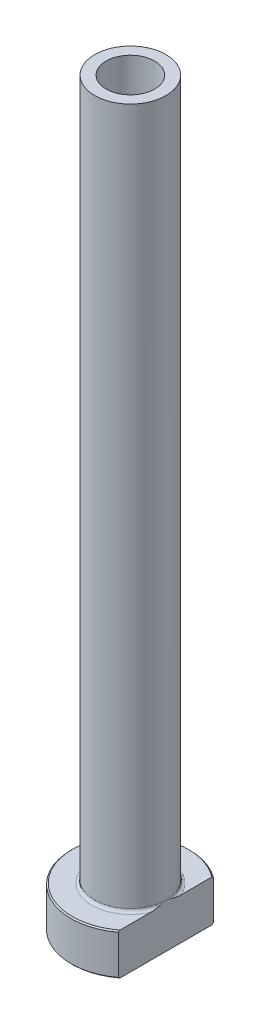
ISO-10303-21;
HEADER;
FILE_DESCRIPTION(('STEP AP214'),'2;1');
FILE_NAME('part.step','',(''),(''),'','','');
FILE_SCHEMA(('AUTOMOTIVE_DESIGN { 1 0 10303 214 1 1 1 1 }'));
ENDSEC;
DATA;
#1=APPLICATION_CONTEXT('core data for automotive mechanical design processes');
#2=APPLICATION_PROTOCOL_DEFINITION('international standard','automotive_design',2000,#1);
#3=PRODUCT_CONTEXT('',#1,'mechanical');
#4=PRODUCT('Part','Part','',(#3));
#5=PRODUCT_RELATED_PRODUCT_CATEGORY('part','',(#4));
#6=PRODUCT_DEFINITION_FORMATION('','',#4);
#7=PRODUCT_DEFINITION_CONTEXT('part definition',#1,'design');
#8=PRODUCT_DEFINITION('design','',#6,#7);
#9=PRODUCT_DEFINITION_SHAPE('','',#8);
#10=(LENGTH_UNIT() NAMED_UNIT(*) SI_UNIT(.MILLI.,.METRE.));
#11=(NAMED_UNIT(*) PLANE_ANGLE_UNIT() SI_UNIT($,.RADIAN.));
#12=(NAMED_UNIT(*) SI_UNIT($,.STERADIAN.) SOLID_ANGLE_UNIT());
#13=UNCERTAINTY_MEASURE_WITH_UNIT(LENGTH_MEASURE(1.E-05),#10,'distance_accuracy_value','');
#14=(GEOMETRIC_REPRESENTATION_CONTEXT(3) GLOBAL_UNCERTAINTY_ASSIGNED_CONTEXT((#13)) GLOBAL_UNIT_ASSIGNED_CONTEXT((#10,
#11,#12)) REPRESENTATION_CONTEXT('',''));
#15=CARTESIAN_POINT('',(0.,0.,0.));
#16=DIRECTION('',(0.,0.,1.));
#17=DIRECTION('',(1.,0.,0.));
#18=AXIS2_PLACEMENT_3D('',#15,#16,#17);
#19=CARTESIAN_POINT('',(0.,92.1876809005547,0.));
#20=DIRECTION('',(0.,1.,0.));
#21=DIRECTION('',(0.,0.,1.));
#22=AXIS2_PLACEMENT_3D('',#19,#20,#21);
#23=CYLINDRICAL_SURFACE('',#22,4.1);
#24=CARTESIAN_POINT('',(0.,125.,0.));
#25=DIRECTION('',(0.,1.,0.));
#26=DIRECTION('',(0.,0.,1.));
#27=AXIS2_PLACEMENT_3D('',#24,#25,#26);
#28=CIRCLE('',#27,4.1);
#29=CARTESIAN_POINT('',(0.,125.,4.1));
#30=VERTEX_POINT('',#29);
#31=EDGE_CURVE('E167',#30,#30,#28,.T.);
#32=ORIENTED_EDGE('',*,*,#31,.T.);
#33=EDGE_LOOP('',(#32));
#34=FACE_BOUND('',#33,.T.);
#35=CARTESIAN_POINT('',(0.,80.,0.));
#36=DIRECTION('',(0.,1.,0.));
#37=DIRECTION('',(0.,0.,1.));
#38=AXIS2_PLACEMENT_3D('',#35,#36,#37);
#39=CIRCLE('',#38,4.1);
#40=CARTESIAN_POINT('',(0.,80.,4.1));
#41=VERTEX_POINT('',#40);
#42=EDGE_CURVE('E170',#41,#41,#39,.T.);
#43=ORIENTED_EDGE('',*,*,#42,.F.);
#44=EDGE_LOOP('',(#43));
#45=FACE_BOUND('',#44,.T.);
#46=ADVANCED_FACE('F32',(#34,#45),#23,.F.);
#47=CARTESIAN_POINT('',(-4.1,125.,0.));
#48=DIRECTION('',(0.,1.,0.));
#49=DIRECTION('',(0.,0.,1.));
#50=AXIS2_PLACEMENT_3D('',#47,#48,#49);
#51=PLANE('',#50);
#52=CARTESIAN_POINT('',(0.,125.,0.));
#53=DIRECTION('',(0.,1.,0.));
#54=DIRECTION('',(0.,0.,1.));
#55=AXIS2_PLACEMENT_3D('',#52,#53,#54);
#56=CIRCLE('',#55,6.);
#57=CARTESIAN_POINT('',(0.,125.,6.));
#58=VERTEX_POINT('',#57);
#59=EDGE_CURVE('E174',#58,#58,#56,.T.);
#60=ORIENTED_EDGE('',*,*,#59,.T.);
#61=EDGE_LOOP('',(#60));
#62=FACE_BOUND('',#61,.T.);
#63=ORIENTED_EDGE('',*,*,#31,.F.);
#64=EDGE_LOOP('',(#63));
#65=FACE_BOUND('',#64,.T.);
#66=ADVANCED_FACE('F157',(#62,#65),#51,.T.);
#67=CARTESIAN_POINT('',(0.,92.1876809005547,0.));
#68=DIRECTION('',(0.,1.,0.));
#69=DIRECTION('',(0.,0.,1.));
#70=AXIS2_PLACEMENT_3D('',#67,#68,#69);
#71=CYLINDRICAL_SURFACE('',#70,6.);
#72=CARTESIAN_POINT('',(0.,7.50000000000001,0.));
#73=DIRECTION('',(0.,1.,0.));
#74=DIRECTION('',(0.,0.,1.));
#75=AXIS2_PLACEMENT_3D('',#72,#73,#74);
#76=CIRCLE('',#75,6.);
#77=CARTESIAN_POINT('',(6.,7.50000000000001,0.));
#78=VERTEX_POINT('',#77);
#79=EDGE_CURVE('E180',#78,#78,#76,.T.);
#80=ORIENTED_EDGE('',*,*,#79,.T.);
#81=EDGE_LOOP('',(#80));
#82=FACE_BOUND('',#81,.T.);
#83=ORIENTED_EDGE('',*,*,#59,.F.);
#84=EDGE_LOOP('',(#83));
#85=FACE_BOUND('',#84,.T.);
#86=ADVANCED_FACE('F162',(#82,#85),#71,.T.);
#87=CARTESIAN_POINT('',(-5.99999999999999,7.,0.));
#88=DIRECTION('',(0.,1.,0.));
#89=DIRECTION('',(0.,0.,1.));
#90=AXIS2_PLACEMENT_3D('',#87,#88,#89);
#91=PLANE('',#90);
#92=DIRECTION('',(0.,0.,1.));
#93=VECTOR('',#92,1.);
#94=CARTESIAN_POINT('',(6.,7.,0.));
#95=LINE('',#94,#93);
#96=CARTESIAN_POINT('',(6.,7.,-7.7485482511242));
#97=VERTEX_POINT('',#96);
#98=CARTESIAN_POINT('',(6.,7.,-2.5));
#99=VERTEX_POINT('',#98);
#100=EDGE_CURVE('E54',#97,#99,#95,.T.);
#101=ORIENTED_EDGE('',*,*,#100,.F.);
#102=CARTESIAN_POINT('',(0.,7.,0.));
#103=DIRECTION('',(0.,1.,0.));
#104=DIRECTION('',(0.,0.,1.));
#105=AXIS2_PLACEMENT_3D('',#102,#103,#104);
#106=CIRCLE('',#105,9.79999999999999);
#107=CARTESIAN_POINT('',(5.99999999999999,7.,7.7485482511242));
#108=VERTEX_POINT('',#107);
#109=EDGE_CURVE('E186',#97,#108,#106,.T.);
#110=ORIENTED_EDGE('',*,*,#109,.T.);
#111=CARTESIAN_POINT('',(6.,7.,2.5));
#112=VERTEX_POINT('',#111);
#113=EDGE_CURVE('E134',#112,#108,#95,.T.);
#114=ORIENTED_EDGE('',*,*,#113,.F.);
#115=CARTESIAN_POINT('',(0.,7.,0.));
#116=DIRECTION('',(0.,1.,0.));
#117=DIRECTION('',(0.,0.,1.));
#118=AXIS2_PLACEMENT_3D('',#115,#116,#117);
#119=CIRCLE('',#118,6.5);
#120=EDGE_CURVE('E183',#112,#99,#119,.F.);
#121=ORIENTED_EDGE('',*,*,#120,.T.);
#122=EDGE_LOOP('',(#101,#110,#114,#121));
#123=FACE_BOUND('',#122,.T.);
#124=ADVANCED_FACE('F197',(#123),#91,.T.);
#125=CARTESIAN_POINT('',(0.,92.1876809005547,0.));
#126=DIRECTION('',(0.,1.,0.));
#127=DIRECTION('',(0.,0.,1.));
#128=AXIS2_PLACEMENT_3D('',#125,#126,#127);
#129=CYLINDRICAL_SURFACE('',#128,9.99999999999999);
#130=DIRECTION('',(0.,-1.,0.));
#131=VECTOR('',#130,1.);
#132=CARTESIAN_POINT('',(5.99999999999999,125.,7.99999999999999));
#133=LINE('',#132,#131);
#134=CARTESIAN_POINT('',(5.99999999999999,6.8,7.99999999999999));
#135=VERTEX_POINT('',#134);
#136=CARTESIAN_POINT('',(5.99999999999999,0.200000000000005,7.99999999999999));
#137=VERTEX_POINT('',#136);
#138=EDGE_CURVE('E82',#135,#137,#133,.T.);
#139=ORIENTED_EDGE('',*,*,#138,.F.);
#140=CARTESIAN_POINT('',(0.,6.8,0.));
#141=DIRECTION('',(0.,1.,0.));
#142=DIRECTION('',(0.,0.,1.));
#143=AXIS2_PLACEMENT_3D('',#140,#141,#142);
#144=CIRCLE('',#143,9.99999999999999);
#145=CARTESIAN_POINT('',(6.,6.8,-7.99999999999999));
#146=VERTEX_POINT('',#145);
#147=EDGE_CURVE('E95',#135,#146,#144,.F.);
#148=ORIENTED_EDGE('',*,*,#147,.T.);
#149=DIRECTION('',(0.,-1.,0.));
#150=VECTOR('',#149,1.);
#151=CARTESIAN_POINT('',(6.,125.,-7.99999999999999));
#152=LINE('',#151,#150);
#153=CARTESIAN_POINT('',(6.,0.200000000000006,-7.99999999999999));
#154=VERTEX_POINT('',#153);
#155=EDGE_CURVE('E192',#146,#154,#152,.T.);
#156=ORIENTED_EDGE('',*,*,#155,.T.);
#157=CARTESIAN_POINT('',(0.,0.200000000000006,0.));
#158=DIRECTION('',(0.,-1.,0.));
#159=DIRECTION('',(0.,0.,-1.));
#160=AXIS2_PLACEMENT_3D('',#157,#158,#159);
#161=CIRCLE('',#160,9.99999999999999);
#162=EDGE_CURVE('E98',#154,#137,#161,.F.);
#163=ORIENTED_EDGE('',*,*,#162,.T.);
#164=EDGE_LOOP('',(#139,#148,#156,#163));
#165=FACE_BOUND('',#164,.T.);
#166=ADVANCED_FACE('F190',(#165),#129,.T.);
#167=CARTESIAN_POINT('',(-9.99999999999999,0.,0.));
#168=DIRECTION('',(0.,-1.,0.));
#169=DIRECTION('',(0.,0.,-1.));
#170=AXIS2_PLACEMENT_3D('',#167,#168,#169);
#171=PLANE('',#170);
#172=CARTESIAN_POINT('',(0.,0.,0.));
#173=DIRECTION('',(0.,-1.,0.));
#174=DIRECTION('',(0.,0.,-1.));
#175=AXIS2_PLACEMENT_3D('',#172,#173,#174);
#176=CIRCLE('',#175,4.84999999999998);
#177=CARTESIAN_POINT('',(0.,0.,-4.84999999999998));
#178=VERTEX_POINT('',#177);
#179=EDGE_CURVE('E40',#178,#178,#176,.F.);
#180=ORIENTED_EDGE('',*,*,#179,.T.);
#181=EDGE_LOOP('',(#180));
#182=FACE_BOUND('',#181,.T.);
#183=DIRECTION('',(0.,0.,-1.));
#184=VECTOR('',#183,1.);
#185=CARTESIAN_POINT('',(5.99999999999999,0.,7.99999999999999));
#186=LINE('',#185,#184);
#187=CARTESIAN_POINT('',(5.99999999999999,0.,7.74854825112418));
#188=VERTEX_POINT('',#187);
#189=CARTESIAN_POINT('',(6.,0.,-7.74854825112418));
#190=VERTEX_POINT('',#189);
#191=EDGE_CURVE('E47',#188,#190,#186,.T.);
#192=ORIENTED_EDGE('',*,*,#191,.F.);
#193=CARTESIAN_POINT('',(0.,0.,0.));
#194=DIRECTION('',(0.,-1.,0.));
#195=DIRECTION('',(0.,0.,-1.));
#196=AXIS2_PLACEMENT_3D('',#193,#194,#195);
#197=CIRCLE('',#196,9.79999999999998);
#198=EDGE_CURVE('E92',#188,#190,#197,.T.);
#199=ORIENTED_EDGE('',*,*,#198,.T.);
#200=EDGE_LOOP('',(#192,#199));
#201=FACE_BOUND('',#200,.T.);
#202=ADVANCED_FACE('F91',(#182,#201),#171,.T.);
#203=CARTESIAN_POINT('',(0.,92.1876809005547,0.));
#204=DIRECTION('',(0.,1.,0.));
#205=DIRECTION('',(0.,0.,1.));
#206=AXIS2_PLACEMENT_3D('',#203,#204,#205);
#207=CYLINDRICAL_SURFACE('',#206,4.34999999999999);
#208=CARTESIAN_POINT('',(0.,0.5,0.));
#209=DIRECTION('',(0.,-1.,0.));
#210=DIRECTION('',(0.,0.,-1.));
#211=AXIS2_PLACEMENT_3D('',#208,#209,#210);
#212=CIRCLE('',#211,4.34999999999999);
#213=CARTESIAN_POINT('',(0.,0.5,-4.34999999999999));
#214=VERTEX_POINT('',#213);
#215=EDGE_CURVE('E11',#214,#214,#212,.T.);
#216=ORIENTED_EDGE('',*,*,#215,.T.);
#217=EDGE_LOOP('',(#216));
#218=FACE_BOUND('',#217,.T.);
#219=CARTESIAN_POINT('',(0.,68.,0.));
#220=DIRECTION('',(0.,1.,0.));
#221=DIRECTION('',(0.,0.,1.));
#222=AXIS2_PLACEMENT_3D('',#219,#220,#221);
#223=CIRCLE('',#222,4.35);
#224=CARTESIAN_POINT('',(0.,68.,4.35));
#225=VERTEX_POINT('',#224);
#226=EDGE_CURVE('E172',#225,#225,#223,.T.);
#227=ORIENTED_EDGE('',*,*,#226,.T.);
#228=EDGE_LOOP('',(#227));
#229=FACE_BOUND('',#228,.T.);
#230=ADVANCED_FACE('F215',(#218,#229),#207,.F.);
#231=CARTESIAN_POINT('',(0.,68.,0.));
#232=DIRECTION('',(0.,-1.,0.));
#233=DIRECTION('',(0.,0.,-1.));
#234=AXIS2_PLACEMENT_3D('',#231,#232,#233);
#235=CONICAL_SURFACE('',#234,4.35,0.0208303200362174);
#236=ORIENTED_EDGE('',*,*,#42,.T.);
#237=EDGE_LOOP('',(#236));
#238=FACE_BOUND('',#237,.T.);
#239=ORIENTED_EDGE('',*,*,#226,.F.);
#240=EDGE_LOOP('',(#239));
#241=FACE_BOUND('',#240,.T.);
#242=ADVANCED_FACE('F111',(#238,#241),#235,.F.);
#243=CARTESIAN_POINT('',(0.,7.50000000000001,0.));
#244=DIRECTION('',(0.,1.,0.));
#245=DIRECTION('',(0.,0.,1.));
#246=AXIS2_PLACEMENT_3D('',#243,#244,#245);
#247=TOROIDAL_SURFACE('',#246,6.5,0.5);
#248=ORIENTED_EDGE('',*,*,#120,.F.);
#249=CARTESIAN_POINT('',(6.,7.50000000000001,0.));
#250=CARTESIAN_POINT('',(6.,7.50000080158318,6.70437634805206E-11));
#251=CARTESIAN_POINT('',(6.,7.50000160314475,2.62462613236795E-07));
#252=CARTESIAN_POINT('',(6.,7.50000311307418,1.01907176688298E-06));
#253=CARTESIAN_POINT('',(6.,7.50000381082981,1.52837915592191E-06));
#254=CARTESIAN_POINT('',(6.,7.5000052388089,2.74467594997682E-06));
#255=CARTESIAN_POINT('',(6.,7.5000059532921,3.47066702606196E-06));
#256=CARTESIAN_POINT('',(6.,7.50000725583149,4.99336157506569E-06));
#257=CARTESIAN_POINT('',(6.,7.50000784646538,5.78800097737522E-06));
#258=CARTESIAN_POINT('',(6.,7.50000997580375,8.79661545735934E-06));
#259=CARTESIAN_POINT('',(6.,7.50001139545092,1.10980668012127E-05));
#260=CARTESIAN_POINT('',(6.,7.50001378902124,1.57116088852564E-05));
#261=CARTESIAN_POINT('',(6.,7.50001478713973,1.80117437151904E-05));
#262=CARTESIAN_POINT('',(6.,7.50001885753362,2.75423829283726E-05));
#263=CARTESIAN_POINT('',(6.,7.500021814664,3.48285069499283E-05));
#264=CARTESIAN_POINT('',(6.,7.50002628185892,4.8740838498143E-05));
#265=CARTESIAN_POINT('',(6.,7.50002793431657,5.53214370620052E-05));
#266=CARTESIAN_POINT('',(6.,7.50003978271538,0.000103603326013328));
#267=CARTESIAN_POINT('',(6.,7.50004857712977,0.000145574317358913));
#268=CARTESIAN_POINT('',(5.99999999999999,7.50008704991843,0.000310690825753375));
#269=CARTESIAN_POINT('',(6.,7.50012394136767,0.0004321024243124));
#270=CARTESIAN_POINT('',(6.,7.50026686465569,0.000911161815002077));
#271=CARTESIAN_POINT('',(6.,7.50036807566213,0.00126981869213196));
#272=CARTESIAN_POINT('',(5.99999999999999,7.50077195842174,0.00268961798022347));
#273=CARTESIAN_POINT('',(5.99999999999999,7.50108058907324,0.00374948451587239));
#274=CARTESIAN_POINT('',(6.,7.50236320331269,0.00816658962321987));
#275=CARTESIAN_POINT('',(6.,7.50332976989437,0.0115254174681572));
#276=CARTESIAN_POINT('',(5.99999999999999,7.51709821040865,0.059354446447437));
#277=CARTESIAN_POINT('',(5.99999999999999,7.52995465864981,0.103813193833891));
#278=CARTESIAN_POINT('',(6.,7.55506029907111,0.190977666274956));
#279=CARTESIAN_POINT('',(6.,7.56731321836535,0.233682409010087));
#280=CARTESIAN_POINT('',(5.99999999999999,7.59325665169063,0.324512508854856));
#281=CARTESIAN_POINT('',(6.,7.60693346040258,0.372641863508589));
#282=CARTESIAN_POINT('',(6.,7.63422038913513,0.469489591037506));
#283=CARTESIAN_POINT('',(6.,7.64782813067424,0.518208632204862));
#284=CARTESIAN_POINT('',(6.,7.68043734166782,0.636338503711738));
#285=CARTESIAN_POINT('',(6.,7.69928754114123,0.705791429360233));
#286=CARTESIAN_POINT('',(6.,7.73566887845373,0.84310273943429));
#287=CARTESIAN_POINT('',(6.,7.75322160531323,0.910955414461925));
#288=CARTESIAN_POINT('',(6.,7.80024878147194,1.09857433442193));
#289=CARTESIAN_POINT('',(6.,7.82864900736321,1.21861610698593));
#290=CARTESIAN_POINT('',(6.,7.88105633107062,1.46081534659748));
#291=CARTESIAN_POINT('',(6.,7.9050208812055,1.58298212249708));
#292=CARTESIAN_POINT('',(6.,7.94810499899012,1.83866408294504));
#293=CARTESIAN_POINT('',(6.,7.96665856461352,1.97228081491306));
#294=CARTESIAN_POINT('',(6.,7.98621697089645,2.17329578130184));
#295=CARTESIAN_POINT('',(6.,7.99135613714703,2.24029152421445));
#296=CARTESIAN_POINT('',(6.,7.99832928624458,2.37444824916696));
#297=CARTESIAN_POINT('',(6.,8.00016429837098,2.44160917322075));
#298=CARTESIAN_POINT('',(6.,7.99984674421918,2.56298631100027));
#299=CARTESIAN_POINT('',(6.,7.99839439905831,2.61720324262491));
#300=CARTESIAN_POINT('',(6.,7.99236557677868,2.72552036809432));
#301=CARTESIAN_POINT('',(6.,7.98778645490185,2.77962042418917));
#302=CARTESIAN_POINT('',(6.,7.97492915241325,2.88664710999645));
#303=CARTESIAN_POINT('',(6.,7.96670262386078,2.93957965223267));
#304=CARTESIAN_POINT('',(6.,7.94570253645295,3.04448333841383));
#305=CARTESIAN_POINT('',(6.,7.93293488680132,3.09645563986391));
#306=CARTESIAN_POINT('',(6.,7.90135968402,3.19943606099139));
#307=CARTESIAN_POINT('',(6.,7.88247175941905,3.25042120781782));
#308=CARTESIAN_POINT('',(6.,7.84818685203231,3.32403783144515));
#309=CARTESIAN_POINT('',(6.,7.83579052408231,3.34806431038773));
#310=CARTESIAN_POINT('',(6.,7.80866016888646,3.39474488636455));
#311=CARTESIAN_POINT('',(6.,7.79392968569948,3.41740099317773));
#312=CARTESIAN_POINT('',(6.,7.76577135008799,3.45524173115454));
#313=CARTESIAN_POINT('',(6.,7.75294719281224,3.47087266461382));
#314=CARTESIAN_POINT('',(6.,7.72556313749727,3.50058040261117));
#315=CARTESIAN_POINT('',(6.,7.71100204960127,3.51465612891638));
#316=CARTESIAN_POINT('',(6.,7.67984897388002,3.54077006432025));
#317=CARTESIAN_POINT('',(6.,7.66323651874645,3.55278430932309));
#318=CARTESIAN_POINT('',(6.,7.62815222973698,3.5737025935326));
#319=CARTESIAN_POINT('',(6.,7.60968501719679,3.58261412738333));
#320=CARTESIAN_POINT('',(6.,7.57639898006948,3.59454653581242));
#321=CARTESIAN_POINT('',(6.,7.56191673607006,3.59850385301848));
#322=CARTESIAN_POINT('',(6.,7.53249228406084,3.60392336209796));
#323=CARTESIAN_POINT('',(6.,7.51755044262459,3.6053874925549));
#324=CARTESIAN_POINT('',(6.,7.48761833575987,3.60568912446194));
#325=CARTESIAN_POINT('',(6.,7.47262803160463,3.6045228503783));
#326=CARTESIAN_POINT('',(6.,7.44306278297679,3.59966500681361));
#327=CARTESIAN_POINT('',(6.,7.42848812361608,3.59597174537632));
#328=CARTESIAN_POINT('',(6.,7.39702156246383,3.58531109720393));
#329=CARTESIAN_POINT('',(6.,7.38031267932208,3.5778073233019));
#330=CARTESIAN_POINT('',(6.,7.34834450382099,3.56018434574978));
#331=CARTESIAN_POINT('',(6.,7.33308764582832,3.55006085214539));
#332=CARTESIAN_POINT('',(6.,7.29715308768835,3.52252389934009));
#333=CARTESIAN_POINT('',(6.,7.27737832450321,3.50394102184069));
#334=CARTESIAN_POINT('',(6.,7.2408841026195,3.4639950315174));
#335=CARTESIAN_POINT('',(6.,7.2241730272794,3.44262455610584));
#336=CARTESIAN_POINT('',(6.,7.18148338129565,3.38088102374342));
#337=CARTESIAN_POINT('',(6.,7.15831783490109,3.33858120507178));
#338=CARTESIAN_POINT('',(6.,7.11822747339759,3.25128083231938));
#339=CARTESIAN_POINT('',(6.,7.10130560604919,3.20627901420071));
#340=CARTESIAN_POINT('',(6.,7.07193388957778,3.11375892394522));
#341=CARTESIAN_POINT('',(6.,7.05959256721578,3.06620687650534));
#342=CARTESIAN_POINT('',(6.,7.03888782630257,2.97022063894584));
#343=CARTESIAN_POINT('',(6.,7.03052890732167,2.92178551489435));
#344=CARTESIAN_POINT('',(6.,7.01697563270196,2.82374574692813));
#345=CARTESIAN_POINT('',(6.,7.01183067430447,2.77413446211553));
#346=CARTESIAN_POINT('',(6.,7.00435015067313,2.67475263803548));
#347=CARTESIAN_POINT('',(6.,7.00201229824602,2.62498226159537));
#348=CARTESIAN_POINT('',(6.,6.99897190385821,2.4937701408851));
#349=CARTESIAN_POINT('',(6.,7.0002500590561,2.4122829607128));
#350=CARTESIAN_POINT('',(6.,7.00775652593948,2.24952135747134));
#351=CARTESIAN_POINT('',(6.,7.013987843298,2.16824709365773));
#352=CARTESIAN_POINT('',(6.,7.03045087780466,2.00575531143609));
#353=CARTESIAN_POINT('',(6.,7.04070001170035,1.92453960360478));
#354=CARTESIAN_POINT('',(6.,7.06442774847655,1.76257601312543));
#355=CARTESIAN_POINT('',(6.,7.07790697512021,1.68182822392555));
#356=CARTESIAN_POINT('',(6.,7.11973611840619,1.45394312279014));
#357=CARTESIAN_POINT('',(6.,7.15113840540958,1.30736987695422));
#358=CARTESIAN_POINT('',(6.,7.21927147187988,1.01717316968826));
#359=CARTESIAN_POINT('',(6.,7.25594155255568,0.873534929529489));
#360=CARTESIAN_POINT('',(6.,7.30765759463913,0.680321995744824));
#361=CARTESIAN_POINT('',(6.,7.32124979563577,0.630351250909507));
#362=CARTESIAN_POINT('',(6.,7.34913735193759,0.529103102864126));
#363=CARTESIAN_POINT('',(6.,7.3634417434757,0.477828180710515));
#364=CARTESIAN_POINT('',(6.,7.38809313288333,0.390268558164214));
#365=CARTESIAN_POINT('',(6.,7.39837954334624,0.353966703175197));
#366=CARTESIAN_POINT('',(6.,7.41893445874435,0.281778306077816));
#367=CARTESIAN_POINT('',(5.99999999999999,7.42920197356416,0.245891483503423));
#368=CARTESIAN_POINT('',(6.,7.4486400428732,0.178137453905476));
#369=CARTESIAN_POINT('',(6.,7.45780513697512,0.146268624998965));
#370=CARTESIAN_POINT('',(5.99999999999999,7.47656016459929,0.0812304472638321));
#371=CARTESIAN_POINT('',(5.99999999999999,7.48615204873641,0.0480615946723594));
#372=CARTESIAN_POINT('',(6.,7.49666961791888,0.0115277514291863));
#373=CARTESIAN_POINT('',(6.,7.49763547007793,0.00817123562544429));
#374=CARTESIAN_POINT('',(5.99999999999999,7.49891791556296,0.00375466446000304));
#375=CARTESIAN_POINT('',(5.99999999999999,7.49922706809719,0.00269301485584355));
#376=CARTESIAN_POINT('',(6.,7.49963158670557,0.00127098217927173));
#377=CARTESIAN_POINT('',(6.,7.49973292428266,0.000911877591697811));
#378=CARTESIAN_POINT('',(6.,7.49987600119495,0.0004322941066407));
#379=CARTESIAN_POINT('',(5.99999999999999,7.49991291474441,0.000310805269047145));
#380=CARTESIAN_POINT('',(6.,7.49995140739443,0.000145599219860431));
#381=CARTESIAN_POINT('',(6.,7.49996020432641,0.000103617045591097));
#382=CARTESIAN_POINT('',(6.,7.49997205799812,5.53238199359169E-05));
#383=CARTESIAN_POINT('',(6.,7.49997371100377,4.87425673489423E-05));
#384=CARTESIAN_POINT('',(6.,7.49997817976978,3.48289237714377E-05));
#385=CARTESIAN_POINT('',(6.,7.4999811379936,2.75421760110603E-05));
#386=CARTESIAN_POINT('',(6.,7.49998520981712,1.80109000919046E-05));
#387=CARTESIAN_POINT('',(6.,7.49998620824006,1.571071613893E-05));
#388=CARTESIAN_POINT('',(6.,7.49998860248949,1.10971286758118E-05));
#389=CARTESIAN_POINT('',(6.,7.49999002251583,8.7956866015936E-06));
#390=CARTESIAN_POINT('',(6.,7.49999215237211,5.78714699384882E-06));
#391=CARTESIAN_POINT('',(6.,7.49999274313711,4.99254350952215E-06));
#392=CARTESIAN_POINT('',(6.,7.49999404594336,3.46994445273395E-06));
#393=CARTESIAN_POINT('',(6.,7.49999476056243,2.74401361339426E-06));
#394=CARTESIAN_POINT('',(6.,7.49999618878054,1.52785977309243E-06));
#395=CARTESIAN_POINT('',(6.,7.49999688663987,1.01863029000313E-06));
#396=CARTESIAN_POINT('',(6.,7.4999983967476,2.62215533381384E-07));
#397=CARTESIAN_POINT('',(6.,7.4999991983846,-6.70451583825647E-11));
#398=CARTESIAN_POINT('',(6.,7.50000000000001,0.));
#399=B_SPLINE_CURVE_WITH_KNOTS('',3,(#249,#250,#251,#252,#253,#254,#255,#256,#257,#258,#259,
#260,#261,#262,#263,#264,#265,#266,#267,#268,#269,#270,#271,#272,#273,#274,#275,#276,#277,#278,
#279,#280,#281,#282,#283,#284,#285,#286,#287,#288,#289,#290,#291,#292,#293,#294,#295,#296,#297,
#298,#299,#300,#301,#302,#303,#304,#305,#306,#307,#308,#309,#310,#311,#312,#313,#314,#315,#316,
#317,#318,#319,#320,#321,#322,#323,#324,#325,#326,#327,#328,#329,#330,#331,#332,#333,#334,#335,
#336,#337,#338,#339,#340,#341,#342,#343,#344,#345,#346,#347,#348,#349,#350,#351,#352,#353,#354,
#355,#356,#357,#358,#359,#360,#361,#362,#363,#364,#365,#366,#367,#368,#369,#370,#371,#372,#373,
#374,#375,#376,#377,#378,#379,#380,#381,#382,#383,#384,#385,#386,#387,#388,#389,#390,#391,#392,
#393,#394,#395,#396,#397,#398),.UNSPECIFIED.,.T.,.F.,(4,2,2,2,2,2,2,2,2,2,2,2,2,2,2,2,2,2,2,2,2,
2,2,2,2,2,2,2,2,2,2,2,2,2,2,2,2,2,2,2,2,2,2,2,2,2,2,2,2,2,2,2,2,2,2,2,2,2,2,2,2,2,2,2,2,2,2,2,2,
2,2,2,2,2,4),(0.,2.4153302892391E-06,5.00162109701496E-06,8.04116379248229E-06,
1.10092366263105E-05,1.90889802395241E-05,2.6604745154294E-05,5.01454154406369E-05,
7.04740122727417E-05,0.000199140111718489,0.000579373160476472,0.00169781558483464,
0.00500893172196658,0.0154949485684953,0.154330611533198,0.287615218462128,0.437719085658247,
0.589470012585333,0.805361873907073,1.01561737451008,1.38561400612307,1.75899405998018,
2.16331287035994,2.3648290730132,2.56628249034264,2.72891861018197,2.89169246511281,
3.05223140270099,3.21256219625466,3.37509011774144,3.45609970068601,3.53698744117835,
3.59753760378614,3.65812948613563,3.71938396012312,3.78048942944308,3.82533702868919,
3.87014974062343,3.91502681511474,3.9599339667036,4.01458097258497,4.06931803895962,
4.15026803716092,4.23143634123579,4.37530581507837,4.51924312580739,4.66640085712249,
4.81372446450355,4.96325999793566,5.11267360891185,5.35695170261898,5.60137814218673,
5.84687607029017,6.09242144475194,6.54191534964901,6.98659302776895,7.1419516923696,
7.30164895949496,7.41484221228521,7.52682205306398,7.62630458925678,7.72988447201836,
7.7403632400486,7.74367992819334,7.74479976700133,7.74518024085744,7.74530894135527,
7.74532927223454,7.74535281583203,7.74536033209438,7.74536841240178,7.74537138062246,
7.74537442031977,7.74537700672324,7.74537942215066),.UNSPECIFIED.);
#400=EDGE_CURVE('E126',#112,#78,#399,.T.);
#401=ORIENTED_EDGE('',*,*,#400,.T.);
#402=ORIENTED_EDGE('',*,*,#79,.F.);
#403=CARTESIAN_POINT('',(6.,7.50000000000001,0.));
#404=CARTESIAN_POINT('',(6.,7.49999919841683,-6.70423652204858E-11));
#405=CARTESIAN_POINT('',(6.,7.49999839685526,-2.62462611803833E-07));
#406=CARTESIAN_POINT('',(6.,7.49999688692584,-1.01907176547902E-06));
#407=CARTESIAN_POINT('',(6.,7.4999961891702,-1.52837915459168E-06));
#408=CARTESIAN_POINT('',(6.,7.49999476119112,-2.74467594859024E-06));
#409=CARTESIAN_POINT('',(6.,7.49999404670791,-3.47066702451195E-06));
#410=CARTESIAN_POINT('',(6.,7.49999274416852,-4.9933615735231E-06));
#411=CARTESIAN_POINT('',(6.,7.49999215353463,-5.78800097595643E-06));
#412=CARTESIAN_POINT('',(6.,7.49999002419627,-8.7966154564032E-06));
#413=CARTESIAN_POINT('',(6.,7.49998860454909,-1.10980667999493E-05));
#414=CARTESIAN_POINT('',(6.,7.49998621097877,-1.5711608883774E-05));
#415=CARTESIAN_POINT('',(6.,7.49998521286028,-1.80117437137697E-05));
#416=CARTESIAN_POINT('',(6.,7.49998114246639,-2.754238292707E-05));
#417=CARTESIAN_POINT('',(6.,7.49997818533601,-3.4828506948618E-05));
#418=CARTESIAN_POINT('',(6.,7.49997371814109,-4.87408384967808E-05));
#419=CARTESIAN_POINT('',(6.,7.49997206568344,-5.53214370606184E-05));
#420=CARTESIAN_POINT('',(6.,7.49996021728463,-0.000103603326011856));
#421=CARTESIAN_POINT('',(6.,7.49995142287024,-0.000145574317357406));
#422=CARTESIAN_POINT('',(5.99999999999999,7.49991295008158,-0.000310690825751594));
#423=CARTESIAN_POINT('',(6.,7.49987605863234,-0.000432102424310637));
#424=CARTESIAN_POINT('',(6.,7.49973313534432,-0.000911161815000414));
#425=CARTESIAN_POINT('',(6.,7.49963192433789,-0.00126981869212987));
#426=CARTESIAN_POINT('',(5.99999999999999,7.49922804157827,-0.002689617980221));
#427=CARTESIAN_POINT('',(5.99999999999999,7.49891941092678,-0.00374948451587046));
#428=CARTESIAN_POINT('',(6.,7.49763679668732,-0.00816658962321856));
#429=CARTESIAN_POINT('',(6.,7.49667023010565,-0.0115254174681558));
#430=CARTESIAN_POINT('',(5.99999999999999,7.48290178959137,-0.0593544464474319));
#431=CARTESIAN_POINT('',(5.99999999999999,7.47004534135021,-0.103813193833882));
#432=CARTESIAN_POINT('',(6.,7.44493970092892,-0.190977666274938));
#433=CARTESIAN_POINT('',(6.,7.43268678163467,-0.233682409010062));
#434=CARTESIAN_POINT('',(5.99999999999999,7.40674334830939,-0.324512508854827));
#435=CARTESIAN_POINT('',(6.,7.39306653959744,-0.372641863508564));
#436=CARTESIAN_POINT('',(6.,7.36577961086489,-0.469489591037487));
#437=CARTESIAN_POINT('',(6.,7.35217186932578,-0.518208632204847));
#438=CARTESIAN_POINT('',(6.,7.3195626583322,-0.63633850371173));
#439=CARTESIAN_POINT('',(6.,7.30071245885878,-0.705791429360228));
#440=CARTESIAN_POINT('',(6.,7.26433112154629,-0.843102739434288));
#441=CARTESIAN_POINT('',(6.,7.24677839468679,-0.910955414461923));
#442=CARTESIAN_POINT('',(6.,7.19975121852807,-1.09857433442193));
#443=CARTESIAN_POINT('',(6.,7.1713509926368,-1.21861610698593));
#444=CARTESIAN_POINT('',(6.,7.11894366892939,-1.46081534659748));
#445=CARTESIAN_POINT('',(6.,7.09497911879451,-1.58298212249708));
#446=CARTESIAN_POINT('',(6.,7.0518950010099,-1.83866408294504));
#447=CARTESIAN_POINT('',(6.,7.03334143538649,-1.97228081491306));
#448=CARTESIAN_POINT('',(6.,7.01378302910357,-2.17329578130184));
#449=CARTESIAN_POINT('',(6.,7.00864386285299,-2.24029152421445));
#450=CARTESIAN_POINT('',(6.,7.00167071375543,-2.37444824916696));
#451=CARTESIAN_POINT('',(6.,6.99983570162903,-2.44160917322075));
#452=CARTESIAN_POINT('',(6.,7.00015325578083,-2.56298631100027));
#453=CARTESIAN_POINT('',(6.,7.0016056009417,-2.61720324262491));
#454=CARTESIAN_POINT('',(6.,7.00763442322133,-2.72552036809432));
#455=CARTESIAN_POINT('',(6.,7.01221354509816,-2.77962042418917));
#456=CARTESIAN_POINT('',(6.,7.02507084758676,-2.88664710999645));
#457=CARTESIAN_POINT('',(6.,7.03329737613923,-2.93957965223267));
#458=CARTESIAN_POINT('',(6.,7.05429746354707,-3.04448333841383));
#459=CARTESIAN_POINT('',(6.,7.06706511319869,-3.09645563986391));
#460=CARTESIAN_POINT('',(6.,7.09864031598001,-3.19943606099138));
#461=CARTESIAN_POINT('',(6.,7.11752824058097,-3.25042120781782));
#462=CARTESIAN_POINT('',(6.,7.1518131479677,-3.32403783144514));
#463=CARTESIAN_POINT('',(6.,7.16420947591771,-3.34806431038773));
#464=CARTESIAN_POINT('',(6.,7.19133983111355,-3.39474488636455));
#465=CARTESIAN_POINT('',(6.,7.20607031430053,-3.41740099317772));
#466=CARTESIAN_POINT('',(6.,7.23422864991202,-3.45524173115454));
#467=CARTESIAN_POINT('',(6.,7.24705280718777,-3.47087266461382));
#468=CARTESIAN_POINT('',(6.,7.27443686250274,-3.50058040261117));
#469=CARTESIAN_POINT('',(6.,7.28899795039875,-3.51465612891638));
#470=CARTESIAN_POINT('',(6.,7.32015102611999,-3.54077006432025));
#471=CARTESIAN_POINT('',(6.,7.33676348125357,-3.55278430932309));
#472=CARTESIAN_POINT('',(6.,7.37184777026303,-3.5737025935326));
#473=CARTESIAN_POINT('',(6.,7.39031498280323,-3.58261412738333));
#474=CARTESIAN_POINT('',(6.,7.42360101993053,-3.59454653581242));
#475=CARTESIAN_POINT('',(6.,7.43808326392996,-3.59850385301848));
#476=CARTESIAN_POINT('',(6.,7.46750771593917,-3.60392336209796));
#477=CARTESIAN_POINT('',(6.,7.48244955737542,-3.6053874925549));
#478=CARTESIAN_POINT('',(6.,7.51238166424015,-3.60568912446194));
#479=CARTESIAN_POINT('',(6.,7.52737196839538,-3.6045228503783));
#480=CARTESIAN_POINT('',(6.,7.55693721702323,-3.59966500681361));
#481=CARTESIAN_POINT('',(6.,7.57151187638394,-3.59597174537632));
#482=CARTESIAN_POINT('',(6.,7.60297843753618,-3.58531109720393));
#483=CARTESIAN_POINT('',(6.,7.61968732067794,-3.5778073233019));
#484=CARTESIAN_POINT('',(6.,7.65165549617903,-3.56018434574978));
#485=CARTESIAN_POINT('',(6.,7.6669123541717,-3.55006085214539));
#486=CARTESIAN_POINT('',(6.,7.70284691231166,-3.52252389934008));
#487=CARTESIAN_POINT('',(6.,7.7226216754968,-3.50394102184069));
#488=CARTESIAN_POINT('',(6.,7.75911589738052,-3.4639950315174));
#489=CARTESIAN_POINT('',(6.,7.77582697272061,-3.44262455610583));
#490=CARTESIAN_POINT('',(6.,7.81851661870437,-3.38088102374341));
#491=CARTESIAN_POINT('',(6.,7.84168216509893,-3.33858120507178));
#492=CARTESIAN_POINT('',(6.,7.88177252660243,-3.25128083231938));
#493=CARTESIAN_POINT('',(6.,7.89869439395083,-3.2062790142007));
#494=CARTESIAN_POINT('',(6.,7.92806611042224,-3.11375892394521));
#495=CARTESIAN_POINT('',(6.,7.94040743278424,-3.06620687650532));
#496=CARTESIAN_POINT('',(6.,7.96111217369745,-2.97022063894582));
#497=CARTESIAN_POINT('',(6.,7.96947109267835,-2.92178551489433));
#498=CARTESIAN_POINT('',(6.,7.98302436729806,-2.8237457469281));
#499=CARTESIAN_POINT('',(6.,7.98816932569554,-2.7741344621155));
#500=CARTESIAN_POINT('',(6.,7.99564984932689,-2.67475263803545));
#501=CARTESIAN_POINT('',(6.,7.99798770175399,-2.62498226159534));
#502=CARTESIAN_POINT('',(6.,8.00102809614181,-2.49377014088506));
#503=CARTESIAN_POINT('',(6.,7.99974994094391,-2.41228296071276));
#504=CARTESIAN_POINT('',(6.,7.99224347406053,-2.2495213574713));
#505=CARTESIAN_POINT('',(6.,7.98601215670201,-2.16824709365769));
#506=CARTESIAN_POINT('',(6.,7.96954912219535,-2.00575531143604));
#507=CARTESIAN_POINT('',(6.,7.95929998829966,-1.92453960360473));
#508=CARTESIAN_POINT('',(6.,7.93557225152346,-1.76257601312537));
#509=CARTESIAN_POINT('',(6.,7.92209302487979,-1.68182822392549));
#510=CARTESIAN_POINT('',(6.,7.88026388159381,-1.45394312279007));
#511=CARTESIAN_POINT('',(6.,7.84886159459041,-1.30736987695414));
#512=CARTESIAN_POINT('',(6.,7.78072852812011,-1.01717316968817));
#513=CARTESIAN_POINT('',(6.,7.74405844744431,-0.873534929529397));
#514=CARTESIAN_POINT('',(6.,7.69234240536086,-0.680321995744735));
#515=CARTESIAN_POINT('',(6.,7.67875020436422,-0.630351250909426));
#516=CARTESIAN_POINT('',(6.,7.6508626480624,-0.529103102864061));
#517=CARTESIAN_POINT('',(6.,7.6365582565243,-0.477828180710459));
#518=CARTESIAN_POINT('',(6.,7.61190686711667,-0.390268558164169));
#519=CARTESIAN_POINT('',(6.,7.60162045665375,-0.353966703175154));
#520=CARTESIAN_POINT('',(6.,7.58106554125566,-0.281778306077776));
#521=CARTESIAN_POINT('',(5.99999999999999,7.57079802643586,-0.245891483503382));
#522=CARTESIAN_POINT('',(6.,7.5513599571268,-0.178137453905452));
#523=CARTESIAN_POINT('',(6.,7.54219486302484,-0.146268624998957));
#524=CARTESIAN_POINT('',(5.99999999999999,7.52343983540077,-0.0812304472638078));
#525=CARTESIAN_POINT('',(5.99999999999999,7.51384795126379,-0.048061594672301));
#526=CARTESIAN_POINT('',(6.,7.50333038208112,-0.0115277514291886));
#527=CARTESIAN_POINT('',(6.,7.50236452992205,-0.00817123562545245));
#528=CARTESIAN_POINT('',(5.99999999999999,7.50108208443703,-0.00375466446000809));
#529=CARTESIAN_POINT('',(5.99999999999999,7.5007729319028,-0.00269301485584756));
#530=CARTESIAN_POINT('',(6.,7.50036841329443,-0.00127098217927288));
#531=CARTESIAN_POINT('',(6.,7.50026707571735,-0.000911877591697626));
#532=CARTESIAN_POINT('',(6.,7.50012399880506,-0.000432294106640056));
#533=CARTESIAN_POINT('',(5.99999999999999,7.5000870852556,-0.000310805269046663));
#534=CARTESIAN_POINT('',(6.,7.50004859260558,-0.000145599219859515));
#535=CARTESIAN_POINT('',(6.,7.50003979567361,-0.000103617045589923));
#536=CARTESIAN_POINT('',(6.,7.50002794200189,-5.53238199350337E-05));
#537=CARTESIAN_POINT('',(6.,7.50002628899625,-4.87425673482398E-05));
#538=CARTESIAN_POINT('',(6.,7.50002182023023,-3.48289237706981E-05));
#539=CARTESIAN_POINT('',(6.,7.50001886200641,-2.75421760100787E-05));
#540=CARTESIAN_POINT('',(6.,7.50001479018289,-1.80109000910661E-05));
#541=CARTESIAN_POINT('',(6.,7.50001379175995,-1.5710716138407E-05));
#542=CARTESIAN_POINT('',(6.,7.50001139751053,-1.10971286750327E-05));
#543=CARTESIAN_POINT('',(6.,7.50000997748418,-8.79568660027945E-06));
#544=CARTESIAN_POINT('',(6.,7.5000078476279,-5.78714699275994E-06));
#545=CARTESIAN_POINT('',(6.,7.5000072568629,-4.99254350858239E-06));
#546=CARTESIAN_POINT('',(6.,7.50000595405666,-3.4699444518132E-06));
#547=CARTESIAN_POINT('',(6.,7.50000523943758,-2.74401361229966E-06));
#548=CARTESIAN_POINT('',(6.,7.50000381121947,-1.52785977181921E-06));
#549=CARTESIAN_POINT('',(6.,7.50000311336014,-1.01863028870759E-06));
#550=CARTESIAN_POINT('',(6.,7.50000160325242,-2.62215532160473E-07));
#551=CARTESIAN_POINT('',(6.,7.50000080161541,6.70463621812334E-11));
#552=CARTESIAN_POINT('',(6.,7.50000000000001,0.));
#553=B_SPLINE_CURVE_WITH_KNOTS('',3,(#403,#404,#405,#406,#407,#408,#409,#410,#411,#412,#413,
#414,#415,#416,#417,#418,#419,#420,#421,#422,#423,#424,#425,#426,#427,#428,#429,#430,#431,#432,
#433,#434,#435,#436,#437,#438,#439,#440,#441,#442,#443,#444,#445,#446,#447,#448,#449,#450,#451,
#452,#453,#454,#455,#456,#457,#458,#459,#460,#461,#462,#463,#464,#465,#466,#467,#468,#469,#470,
#471,#472,#473,#474,#475,#476,#477,#478,#479,#480,#481,#482,#483,#484,#485,#486,#487,#488,#489,
#490,#491,#492,#493,#494,#495,#496,#497,#498,#499,#500,#501,#502,#503,#504,#505,#506,#507,#508,
#509,#510,#511,#512,#513,#514,#515,#516,#517,#518,#519,#520,#521,#522,#523,#524,#525,#526,#527,
#528,#529,#530,#531,#532,#533,#534,#535,#536,#537,#538,#539,#540,#541,#542,#543,#544,#545,#546,
#547,#548,#549,#550,#551,#552),.UNSPECIFIED.,.T.,.F.,(4,2,2,2,2,2,2,2,2,2,2,2,2,2,2,2,2,2,2,2,2,
2,2,2,2,2,2,2,2,2,2,2,2,2,2,2,2,2,2,2,2,2,2,2,2,2,2,2,2,2,2,2,2,2,2,2,2,2,2,2,2,2,2,2,2,2,2,2,2,
2,2,2,2,2,4),(0.,2.41533028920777E-06,5.00162109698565E-06,8.04116379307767E-06,
1.10092366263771E-05,1.90889802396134E-05,2.66047451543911E-05,5.01454154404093E-05,
7.04740122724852E-05,0.000199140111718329,0.000579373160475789,0.00169781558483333,
0.00500893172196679,0.0154949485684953,0.154330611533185,0.287615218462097,0.437719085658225,
0.589470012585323,0.805361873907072,1.01561737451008,1.38561400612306,1.75899405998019,
2.16331287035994,2.3648290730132,2.56628249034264,2.72891861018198,2.89169246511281,
3.05223140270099,3.21256219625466,3.37509011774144,3.45609970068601,3.53698744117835,
3.59753760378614,3.65812948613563,3.71938396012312,3.78048942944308,3.8253370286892,
3.87014974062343,3.91502681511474,3.9599339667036,4.01458097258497,4.06931803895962,
4.15026803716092,4.2314363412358,4.37530581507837,4.5192431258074,4.66640085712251,
4.81372446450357,4.96325999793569,5.11267360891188,5.35695170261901,5.60137814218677,
5.84687607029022,6.092421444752,6.54191534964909,6.98659302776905,7.14195169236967,
7.30164895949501,7.41484221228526,7.52682205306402,7.6263045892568,7.72988447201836,
7.7403632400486,7.74367992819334,7.74479976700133,7.74518024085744,7.74530894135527,
7.74532927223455,7.74535281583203,7.74536033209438,7.74536841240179,7.74537138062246,
7.74537442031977,7.74537700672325,7.74537942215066),.UNSPECIFIED.);
#554=EDGE_CURVE('E135',#78,#99,#553,.T.);
#555=ORIENTED_EDGE('',*,*,#554,.T.);
#556=EDGE_LOOP('',(#248,#401,#402,#555));
#557=FACE_BOUND('',#556,.T.);
#558=ADVANCED_FACE('F141',(#557),#247,.F.);
#559=CARTESIAN_POINT('',(0.,7.00000000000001,0.));
#560=DIRECTION('',(0.,-1.,0.));
#561=DIRECTION('',(0.,0.,-1.));
#562=AXIS2_PLACEMENT_3D('',#559,#560,#561);
#563=CONICAL_SURFACE('',#562,9.79999999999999,0.785398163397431);
#564=CARTESIAN_POINT('',(6.,-1.795522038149,-17.6009499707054));
#565=CARTESIAN_POINT('',(6.,-1.52401937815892,-17.3141017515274));
#566=CARTESIAN_POINT('',(6.,-1.25287676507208,-17.0269132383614));
#567=CARTESIAN_POINT('',(6.,-0.711434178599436,-16.4517398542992));
#568=CARTESIAN_POINT('',(6.,-0.441134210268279,-16.1637549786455));
#569=CARTESIAN_POINT('',(6.,0.36894074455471,-15.2977662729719));
#570=CARTESIAN_POINT('',(6.,0.907258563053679,-14.718395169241));
#571=CARTESIAN_POINT('',(6.,1.72215780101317,-13.8331216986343));
#572=CARTESIAN_POINT('',(6.,2.0007113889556,-13.5290344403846));
#573=CARTESIAN_POINT('',(6.,2.55603074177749,-12.9192325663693));
#574=CARTESIAN_POINT('',(6.,2.83279651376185,-12.6135179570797));
#575=CARTESIAN_POINT('',(6.,3.38385174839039,-12.0004608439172));
#576=CARTESIAN_POINT('',(6.,3.65814356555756,-11.6931204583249));
#577=CARTESIAN_POINT('',(6.,4.20403297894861,-11.0760595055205));
#578=CARTESIAN_POINT('',(6.,4.47563060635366,-10.7663389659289));
#579=CARTESIAN_POINT('',(6.,5.01505245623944,-10.1444038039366));
#580=CARTESIAN_POINT('',(6.,5.28288153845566,-9.83219340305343));
#581=CARTESIAN_POINT('',(6.,5.81422935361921,-9.20408822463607));
#582=CARTESIAN_POINT('',(6.,6.07774785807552,-8.88819325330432));
#583=CARTESIAN_POINT('',(6.,6.60003626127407,-8.25062578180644));
#584=CARTESIAN_POINT('',(6.,6.85878611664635,-7.92893682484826));
#585=CARTESIAN_POINT('',(6.,7.36859509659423,-7.27955943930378));
#586=CARTESIAN_POINT('',(6.,7.61965542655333,-6.95187196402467));
#587=CARTESIAN_POINT('',(6.,7.98576066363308,-6.45775713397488));
#588=CARTESIAN_POINT('',(6.,8.10486172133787,-6.29433436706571));
#589=CARTESIAN_POINT('',(6.,8.34000134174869,-5.9653036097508));
#590=CARTESIAN_POINT('',(6.,8.45604001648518,-5.79969569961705));
#591=CARTESIAN_POINT('',(6.,8.68455547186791,-5.4658267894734));
#592=CARTESIAN_POINT('',(6.,8.79702913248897,-5.29756364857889));
#593=CARTESIAN_POINT('',(6.,9.01753757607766,-4.95816178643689));
#594=CARTESIAN_POINT('',(6.,9.12557269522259,-4.78702328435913));
#595=CARTESIAN_POINT('',(6.,9.3356082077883,-4.44248614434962));
#596=CARTESIAN_POINT('',(6.,9.43764111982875,-4.26910741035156));
#597=CARTESIAN_POINT('',(6.,9.63518094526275,-3.91862113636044));
#598=CARTESIAN_POINT('',(6.,9.73068703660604,-3.74151313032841));
#599=CARTESIAN_POINT('',(6.,9.91348788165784,-3.38344678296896));
#600=CARTESIAN_POINT('',(6.,10.0007956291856,-3.20249511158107));
#601=CARTESIAN_POINT('',(6.,10.1654678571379,-2.83615347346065));
#602=CARTESIAN_POINT('',(6.,10.242836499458,-2.65076540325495));
#603=CARTESIAN_POINT('',(6.,10.3476493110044,-2.37476230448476));
#604=CARTESIAN_POINT('',(6.,10.3798377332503,-2.28593872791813));
#605=CARTESIAN_POINT('',(6.,10.4412613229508,-2.10727300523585));
#606=CARTESIAN_POINT('',(6.,10.470496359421,-2.01743081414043));
#607=CARTESIAN_POINT('',(6.,10.5533861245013,-1.74635894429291));
#608=CARTESIAN_POINT('',(6.,10.6022144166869,-1.56361273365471));
#609=CARTESIAN_POINT('',(6.,10.6846214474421,-1.19573724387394));
#610=CARTESIAN_POINT('',(6.,10.718282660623,-1.01062662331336));
#611=CARTESIAN_POINT('',(6.,10.7689812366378,-0.638123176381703));
#612=CARTESIAN_POINT('',(6.,10.7860205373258,-0.450730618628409));
#613=CARTESIAN_POINT('',(6.,10.8025183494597,-0.0738640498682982));
#614=CARTESIAN_POINT('',(6.,10.8018548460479,0.115615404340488));
#615=CARTESIAN_POINT('',(6.,10.7826880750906,0.493653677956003));
#616=CARTESIAN_POINT('',(6.,10.7641846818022,0.682212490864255));
#617=CARTESIAN_POINT('',(6.,10.710325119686,1.05776266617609));
#618=CARTESIAN_POINT('',(6.,10.6748911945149,1.24474270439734));
#619=CARTESIAN_POINT('',(6.,10.5890121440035,1.61520150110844));
#620=CARTESIAN_POINT('',(6.,10.5385638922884,1.79867952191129));
#621=CARTESIAN_POINT('',(6.,10.3911282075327,2.26914112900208));
#622=CARTESIAN_POINT('',(6.,10.2842782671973,2.55302531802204));
#623=CARTESIAN_POINT('',(6.,10.0463958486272,3.11045503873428));
#624=CARTESIAN_POINT('',(6.,9.91534345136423,3.38399182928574));
#625=CARTESIAN_POINT('',(6.,9.70492342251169,3.78859721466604));
#626=CARTESIAN_POINT('',(5.99999999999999,9.63209854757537,3.92313856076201));
#627=CARTESIAN_POINT('',(5.99999999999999,9.48259417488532,4.19006838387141));
#628=CARTESIAN_POINT('',(5.99999999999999,9.40591462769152,4.32245683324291));
#629=CARTESIAN_POINT('',(5.99999999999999,9.24930540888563,4.58520549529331));
#630=CARTESIAN_POINT('',(5.99999999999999,9.169377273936,4.71556662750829));
#631=CARTESIAN_POINT('',(5.99999999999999,9.00669783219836,4.9745035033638));
#632=CARTESIAN_POINT('',(5.99999999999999,8.92394663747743,5.10307931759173));
#633=CARTESIAN_POINT('',(5.99999999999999,8.64351229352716,5.52985219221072));
#634=CARTESIAN_POINT('',(5.99999999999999,8.44039926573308,5.8244859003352));
#635=CARTESIAN_POINT('',(5.99999999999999,8.0246071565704,6.4069492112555));
#636=CARTESIAN_POINT('',(5.99999999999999,7.81192597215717,6.69477729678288));
#637=CARTESIAN_POINT('',(5.99999999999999,7.37931497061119,7.26525171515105));
#638=CARTESIAN_POINT('',(5.99999999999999,7.1593799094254,7.54789405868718));
#639=CARTESIAN_POINT('',(5.99999999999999,6.71413940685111,8.10886295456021));
#640=CARTESIAN_POINT('',(5.99999999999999,6.48883440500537,8.38718985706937));
#641=CARTESIAN_POINT('',(5.99999999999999,6.03331036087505,8.94128328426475));
#642=CARTESIAN_POINT('',(5.99999999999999,5.80307787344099,9.21703873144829));
#643=CARTESIAN_POINT('',(5.99999999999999,5.3392797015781,9.76573512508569));
#644=CARTESIAN_POINT('',(5.99999999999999,5.1057139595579,10.0386760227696));
#645=CARTESIAN_POINT('',(5.99999999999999,4.63600560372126,10.5821276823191));
#646=CARTESIAN_POINT('',(5.99999999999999,4.39986411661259,10.8526394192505));
#647=CARTESIAN_POINT('',(5.99999999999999,3.92539621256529,11.3917411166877));
#648=CARTESIAN_POINT('',(5.99999999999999,3.6870697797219,11.6603310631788));
#649=CARTESIAN_POINT('',(5.99999999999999,3.01761185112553,12.4097238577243));
#650=CARTESIAN_POINT('',(5.99999999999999,2.58447471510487,12.8887346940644));
#651=CARTESIAN_POINT('',(5.99999999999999,1.71393239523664,13.8429570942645));
#652=CARTESIAN_POINT('',(5.99999999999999,1.27652670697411,14.3181681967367));
#653=CARTESIAN_POINT('',(5.99999999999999,0.401335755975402,15.2626172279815));
#654=CARTESIAN_POINT('',(5.99999999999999,-0.0364292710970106,15.7318739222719));
#655=CARTESIAN_POINT('',(5.99999999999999,-0.694863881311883,16.4340144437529));
#656=CARTESIAN_POINT('',(5.99999999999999,-0.914623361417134,16.6677530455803));
#657=CARTESIAN_POINT('',(5.99999999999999,-1.35468319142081,17.1347195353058));
#658=CARTESIAN_POINT('',(5.99999999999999,-1.57498354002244,17.3679474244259));
#659=CARTESIAN_POINT('',(5.99999999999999,-1.79552203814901,17.6009499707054));
#660=B_SPLINE_CURVE_WITH_KNOTS('',3,(#564,#565,#566,#567,#568,#569,#570,#571,#572,#573,#574,
#575,#576,#577,#578,#579,#580,#581,#582,#583,#584,#585,#586,#587,#588,#589,#590,#591,#592,#593,
#594,#595,#596,#597,#598,#599,#600,#601,#602,#603,#604,#605,#606,#607,#608,#609,#610,#611,#612,
#613,#614,#615,#616,#617,#618,#619,#620,#621,#622,#623,#624,#625,#626,#627,#628,#629,#630,#631,
#632,#633,#634,#635,#636,#637,#638,#639,#640,#641,#642,#643,#644,#645,#646,#647,#648,#649,#650,
#651,#652,#653,#654,#655,#656,#657,#658,#659),.UNSPECIFIED.,.F.,.F.,(4,2,2,2,2,2,2,2,2,2,2,2,2,
2,2,2,2,2,2,2,2,2,2,2,2,2,2,2,2,2,2,2,2,2,2,2,2,2,2,2,2,2,2,2,2,2,2,4),(0.,1.18488703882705,
2.36978117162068,4.74232601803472,5.97947486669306,7.21661879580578,8.45242468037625,
9.68821624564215,10.9222327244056,12.1563144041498,13.3947518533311,14.6329941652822,
15.2396202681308,15.8462241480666,16.4533450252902,17.0604198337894,17.6638266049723,
18.2673092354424,18.8698186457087,19.4720749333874,19.7554574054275,20.0388524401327,
20.6057348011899,21.1694962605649,21.733191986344,22.3007739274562,22.8683598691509,
23.4385779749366,24.0089148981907,24.917253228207,25.8263424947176,26.2852509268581,
26.7441652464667,27.2028649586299,27.6615464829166,28.7348221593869,29.8083349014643,
30.8826415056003,31.9568604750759,33.0345254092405,34.1122089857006,35.1894386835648,
36.2666762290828,38.2040405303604,40.1416366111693,42.0668676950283,43.0293387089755,
43.9918074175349),.UNSPECIFIED.);
#661=EDGE_CURVE('E133',#146,#97,#660,.T.);
#662=ORIENTED_EDGE('',*,*,#661,.F.);
#663=ORIENTED_EDGE('',*,*,#147,.F.);
#664=EDGE_CURVE('E118',#108,#135,#660,.T.);
#665=ORIENTED_EDGE('',*,*,#664,.F.);
#666=ORIENTED_EDGE('',*,*,#109,.F.);
#667=EDGE_LOOP('',(#662,#663,#665,#666));
#668=FACE_BOUND('',#667,.T.);
#669=ADVANCED_FACE('F145',(#668),#563,.T.);
#670=CARTESIAN_POINT('',(0.,0.200000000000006,0.));
#671=DIRECTION('',(0.,1.,0.));
#672=DIRECTION('',(0.,0.,1.));
#673=AXIS2_PLACEMENT_3D('',#670,#671,#672);
#674=CONICAL_SURFACE('',#673,9.99999999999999,0.785398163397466);
#675=CARTESIAN_POINT('',(5.99999999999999,8.79552203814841,17.6009499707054));
#676=CARTESIAN_POINT('',(5.99999999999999,8.52401937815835,17.3141017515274));
#677=CARTESIAN_POINT('',(5.99999999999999,8.25287676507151,17.0269132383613));
#678=CARTESIAN_POINT('',(5.99999999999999,7.7114341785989,16.4517398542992));
#679=CARTESIAN_POINT('',(5.99999999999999,7.44113421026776,16.1637549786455));
#680=CARTESIAN_POINT('',(5.99999999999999,6.63105925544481,15.2977662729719));
#681=CARTESIAN_POINT('',(5.99999999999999,6.09274143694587,14.718395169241));
#682=CARTESIAN_POINT('',(5.99999999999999,5.27784219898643,13.8331216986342));
#683=CARTESIAN_POINT('',(5.99999999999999,4.99928861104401,13.5290344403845));
#684=CARTESIAN_POINT('',(5.99999999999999,4.44396925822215,12.9192325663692));
#685=CARTESIAN_POINT('',(5.99999999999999,4.1672034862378,12.6135179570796));
#686=CARTESIAN_POINT('',(5.99999999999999,3.61614825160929,12.0004608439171));
#687=CARTESIAN_POINT('',(5.99999999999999,3.34185643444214,11.6931204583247));
#688=CARTESIAN_POINT('',(5.99999999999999,2.79596702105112,11.0760595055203));
#689=CARTESIAN_POINT('',(5.99999999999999,2.52436939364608,10.7663389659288));
#690=CARTESIAN_POINT('',(5.99999999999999,1.98494754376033,10.1444038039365));
#691=CARTESIAN_POINT('',(5.99999999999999,1.71711846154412,9.83219340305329));
#692=CARTESIAN_POINT('',(5.99999999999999,1.18577064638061,9.20408822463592));
#693=CARTESIAN_POINT('',(5.99999999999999,0.922252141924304,8.88819325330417));
#694=CARTESIAN_POINT('',(5.99999999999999,0.399963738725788,8.25062578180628));
#695=CARTESIAN_POINT('',(5.99999999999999,0.141213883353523,7.92893682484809));
#696=CARTESIAN_POINT('',(5.99999999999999,-0.368595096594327,7.2795594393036));
#697=CARTESIAN_POINT('',(5.99999999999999,-0.619655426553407,6.95187196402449));
#698=CARTESIAN_POINT('',(5.99999999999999,-0.985760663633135,6.45775713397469));
#699=CARTESIAN_POINT('',(5.99999999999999,-1.10486172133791,6.29433436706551));
#700=CARTESIAN_POINT('',(5.99999999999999,-1.34000134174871,5.96530360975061));
#701=CARTESIAN_POINT('',(5.99999999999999,-1.4560400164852,5.79969569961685));
#702=CARTESIAN_POINT('',(5.99999999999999,-1.68455547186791,5.4658267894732));
#703=CARTESIAN_POINT('',(5.99999999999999,-1.79702913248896,5.29756364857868));
#704=CARTESIAN_POINT('',(5.99999999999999,-2.01753757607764,4.95816178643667));
#705=CARTESIAN_POINT('',(5.99999999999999,-2.12557269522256,4.78702328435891));
#706=CARTESIAN_POINT('',(5.99999999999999,-2.33560820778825,4.4424861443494));
#707=CARTESIAN_POINT('',(5.99999999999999,-2.43764111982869,4.26910741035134));
#708=CARTESIAN_POINT('',(5.99999999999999,-2.63518094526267,3.91862113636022));
#709=CARTESIAN_POINT('',(6.,-2.73068703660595,3.74151313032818));
#710=CARTESIAN_POINT('',(6.,-2.91348788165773,3.38344678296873));
#711=CARTESIAN_POINT('',(6.,-3.00079562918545,3.20249511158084));
#712=CARTESIAN_POINT('',(6.,-3.16546785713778,2.83615347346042));
#713=CARTESIAN_POINT('',(6.,-3.24283649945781,2.65076540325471));
#714=CARTESIAN_POINT('',(6.,-3.3476493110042,2.37476230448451));
#715=CARTESIAN_POINT('',(6.,-3.37983773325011,2.28593872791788));
#716=CARTESIAN_POINT('',(6.,-3.44126132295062,2.10727300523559));
#717=CARTESIAN_POINT('',(6.,-3.47049635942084,2.01743081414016));
#718=CARTESIAN_POINT('',(6.,-3.55338612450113,1.74635894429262));
#719=CARTESIAN_POINT('',(6.,-3.60221441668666,1.56361273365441));
#720=CARTESIAN_POINT('',(6.,-3.68462144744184,1.19573724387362));
#721=CARTESIAN_POINT('',(6.,-3.71828266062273,1.01062662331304));
#722=CARTESIAN_POINT('',(6.,-3.76898123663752,0.638123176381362));
#723=CARTESIAN_POINT('',(6.,-3.78602053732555,0.450730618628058));
#724=CARTESIAN_POINT('',(6.,-3.80251834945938,0.0738640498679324));
#725=CARTESIAN_POINT('',(6.,-3.80185484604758,-0.11561540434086));
#726=CARTESIAN_POINT('',(6.,-3.78268807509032,-0.493653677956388));
#727=CARTESIAN_POINT('',(6.,-3.76418468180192,-0.682212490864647));
#728=CARTESIAN_POINT('',(6.,-3.71032511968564,-1.05776266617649));
#729=CARTESIAN_POINT('',(6.,-3.67489119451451,-1.24474270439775));
#730=CARTESIAN_POINT('',(6.,-3.58901214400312,-1.61520150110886));
#731=CARTESIAN_POINT('',(6.,-3.53856389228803,-1.79867952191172));
#732=CARTESIAN_POINT('',(6.,-3.39112820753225,-2.26914112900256));
#733=CARTESIAN_POINT('',(6.,-3.28427826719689,-2.55302531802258));
#734=CARTESIAN_POINT('',(6.,-3.04639584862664,-3.11045503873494));
#735=CARTESIAN_POINT('',(5.99999999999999,-2.91534345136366,-3.38399182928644));
#736=CARTESIAN_POINT('',(6.,-2.70492342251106,-3.78859721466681));
#737=CARTESIAN_POINT('',(6.,-2.63209854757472,-3.92313856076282));
#738=CARTESIAN_POINT('',(6.,-2.48259417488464,-4.19006838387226));
#739=CARTESIAN_POINT('',(6.,-2.40591462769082,-4.32245683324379));
#740=CARTESIAN_POINT('',(6.,-2.24930540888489,-4.58520549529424));
#741=CARTESIAN_POINT('',(6.,-2.16937727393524,-4.71556662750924));
#742=CARTESIAN_POINT('',(6.,-2.00669783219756,-4.9745035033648));
#743=CARTESIAN_POINT('',(6.,-1.92394663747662,-5.10307931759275));
#744=CARTESIAN_POINT('',(6.,-1.64351229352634,-5.52985219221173));
#745=CARTESIAN_POINT('',(6.,-1.44039926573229,-5.82448590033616));
#746=CARTESIAN_POINT('',(6.,-1.02460715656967,-6.40694921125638));
#747=CARTESIAN_POINT('',(6.,-0.811925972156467,-6.69477729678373));
#748=CARTESIAN_POINT('',(6.,-0.379314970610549,-7.26525171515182));
#749=CARTESIAN_POINT('',(6.,-0.159379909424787,-7.54789405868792));
#750=CARTESIAN_POINT('',(6.,0.285860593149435,-8.10886295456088));
#751=CARTESIAN_POINT('',(6.,0.511165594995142,-8.38718985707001));
#752=CARTESIAN_POINT('',(6.,0.966689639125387,-8.94128328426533));
#753=CARTESIAN_POINT('',(6.,1.1969221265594,-9.21703873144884));
#754=CARTESIAN_POINT('',(6.,1.66072029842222,-9.76573512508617));
#755=CARTESIAN_POINT('',(6.,1.89428604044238,-10.03867602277));
#756=CARTESIAN_POINT('',(6.,2.36399439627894,-10.5821276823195));
#757=CARTESIAN_POINT('',(6.,2.60013588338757,-10.8526394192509));
#758=CARTESIAN_POINT('',(6.,3.0746037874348,-11.391741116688));
#759=CARTESIAN_POINT('',(6.,3.31293022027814,-11.6603310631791));
#760=CARTESIAN_POINT('',(6.,3.98238814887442,-12.4097238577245));
#761=CARTESIAN_POINT('',(6.,4.41552528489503,-12.8887346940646));
#762=CARTESIAN_POINT('',(6.,5.28606760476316,-13.8429570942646));
#763=CARTESIAN_POINT('',(6.,5.72347329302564,-14.3181681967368));
#764=CARTESIAN_POINT('',(6.,6.59866424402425,-15.2626172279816));
#765=CARTESIAN_POINT('',(6.,7.03642927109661,-15.731873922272));
#766=CARTESIAN_POINT('',(6.,7.69486388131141,-16.4340144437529));
#767=CARTESIAN_POINT('',(6.,7.91462336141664,-16.6677530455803));
#768=CARTESIAN_POINT('',(6.,8.35468319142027,-17.1347195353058));
#769=CARTESIAN_POINT('',(6.,8.57498354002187,-17.3679474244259));
#770=CARTESIAN_POINT('',(6.,8.79552203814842,-17.6009499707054));
#771=B_SPLINE_CURVE_WITH_KNOTS('',3,(#675,#676,#677,#678,#679,#680,#681,#682,#683,#684,#685,
#686,#687,#688,#689,#690,#691,#692,#693,#694,#695,#696,#697,#698,#699,#700,#701,#702,#703,#704,
#705,#706,#707,#708,#709,#710,#711,#712,#713,#714,#715,#716,#717,#718,#719,#720,#721,#722,#723,
#724,#725,#726,#727,#728,#729,#730,#731,#732,#733,#734,#735,#736,#737,#738,#739,#740,#741,#742,
#743,#744,#745,#746,#747,#748,#749,#750,#751,#752,#753,#754,#755,#756,#757,#758,#759,#760,#761,
#762,#763,#764,#765,#766,#767,#768,#769,#770),.UNSPECIFIED.,.F.,.F.,(4,2,2,2,2,2,2,2,2,2,2,2,2,
2,2,2,2,2,2,2,2,2,2,2,2,2,2,2,2,2,2,2,2,2,2,2,2,2,2,2,2,2,2,2,2,2,2,4),(0.,1.18488703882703,
2.36978117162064,4.74232601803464,5.97947486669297,7.21661879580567,8.45242468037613,
9.68821624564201,10.9222327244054,12.1563144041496,13.3947518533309,14.632994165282,
15.2396202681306,15.8462241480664,16.4533450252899,17.0604198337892,17.663826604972,
18.2673092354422,18.8698186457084,19.4720749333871,19.7554574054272,20.0388524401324,
20.6057348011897,21.1694962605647,21.7331919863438,22.3007739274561,22.8683598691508,
23.4385779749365,24.0089148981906,24.9172532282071,25.8263424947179,26.2852509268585,
26.7441652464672,27.2028649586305,27.6615464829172,28.7348221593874,29.8083349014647,
30.8826415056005,31.956860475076,33.0345254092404,34.1122089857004,35.1894386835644,
36.2666762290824,38.2040405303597,40.1416366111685,42.0668676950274,43.0293387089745,
43.9918074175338),.UNSPECIFIED.);
#772=EDGE_CURVE('E79',#137,#188,#771,.T.);
#773=ORIENTED_EDGE('',*,*,#772,.F.);
#774=ORIENTED_EDGE('',*,*,#162,.F.);
#775=EDGE_CURVE('E87',#190,#154,#771,.T.);
#776=ORIENTED_EDGE('',*,*,#775,.F.);
#777=ORIENTED_EDGE('',*,*,#198,.F.);
#778=EDGE_LOOP('',(#773,#774,#776,#777));
#779=FACE_BOUND('',#778,.T.);
#780=ADVANCED_FACE('F94',(#779),#674,.T.);
#781=CARTESIAN_POINT('',(5.99999999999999,125.,7.99999999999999));
#782=DIRECTION('',(-1.,0.,0.));
#783=DIRECTION('',(0.,0.,1.));
#784=AXIS2_PLACEMENT_3D('',#781,#782,#783);
#785=PLANE('',#784);
#786=ORIENTED_EDGE('',*,*,#400,.F.);
#787=ORIENTED_EDGE('',*,*,#113,.T.);
#788=ORIENTED_EDGE('',*,*,#664,.T.);
#789=ORIENTED_EDGE('',*,*,#138,.T.);
#790=ORIENTED_EDGE('',*,*,#772,.T.);
#791=ORIENTED_EDGE('',*,*,#191,.T.);
#792=ORIENTED_EDGE('',*,*,#775,.T.);
#793=ORIENTED_EDGE('',*,*,#155,.F.);
#794=ORIENTED_EDGE('',*,*,#661,.T.);
#795=ORIENTED_EDGE('',*,*,#100,.T.);
#796=ORIENTED_EDGE('',*,*,#554,.F.);
#797=EDGE_LOOP('',(#786,#787,#788,#789,#790,#791,#792,#793,#794,#795,#796));
#798=FACE_BOUND('',#797,.T.);
#799=ADVANCED_FACE('F80',(#798),#785,.F.);
#800=CARTESIAN_POINT('',(0.,0.,0.));
#801=DIRECTION('',(0.,-1.,0.));
#802=DIRECTION('',(0.,0.,-1.));
#803=AXIS2_PLACEMENT_3D('',#800,#801,#802);
#804=CONICAL_SURFACE('',#803,4.84999999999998,0.785398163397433);
#805=ORIENTED_EDGE('',*,*,#215,.F.);
#806=EDGE_LOOP('',(#805));
#807=FACE_BOUND('',#806,.T.);
#808=ORIENTED_EDGE('',*,*,#179,.F.);
#809=EDGE_LOOP('',(#808));
#810=FACE_BOUND('',#809,.T.);
#811=ADVANCED_FACE('F34',(#807,#810),#804,.F.);
#812=CLOSED_SHELL('',(#46,#66,#86,#124,#166,#202,#230,#242,#558,#669,#780,#799,#811));
#813=MANIFOLD_SOLID_BREP('B2',#812);
#814=ADVANCED_BREP_SHAPE_REPRESENTATION('',(#18,#813),#14);
#815=SHAPE_DEFINITION_REPRESENTATION(#9,#814);
ENDSEC;
END-ISO-10303-21;
